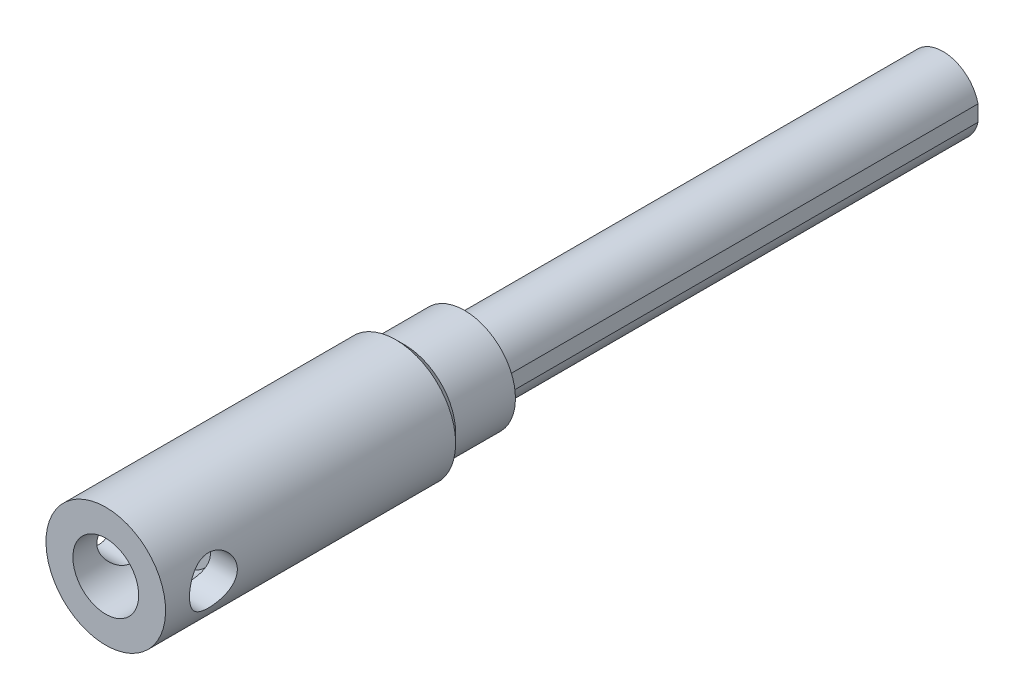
ISO-10303-21;
HEADER;
FILE_DESCRIPTION(('STEP AP214'),'2;1');
FILE_NAME('part.step','',(''),(''),'','','');
FILE_SCHEMA(('AUTOMOTIVE_DESIGN { 1 0 10303 214 1 1 1 1 }'));
ENDSEC;
DATA;
#1=APPLICATION_CONTEXT('core data for automotive mechanical design processes');
#2=APPLICATION_PROTOCOL_DEFINITION('international standard','automotive_design',2000,#1);
#3=PRODUCT_CONTEXT('',#1,'mechanical');
#4=PRODUCT('Part','Part','',(#3));
#5=PRODUCT_RELATED_PRODUCT_CATEGORY('part','',(#4));
#6=PRODUCT_DEFINITION_FORMATION('','',#4);
#7=PRODUCT_DEFINITION_CONTEXT('part definition',#1,'design');
#8=PRODUCT_DEFINITION('design','',#6,#7);
#9=PRODUCT_DEFINITION_SHAPE('','',#8);
#10=(LENGTH_UNIT() NAMED_UNIT(*) SI_UNIT(.MILLI.,.METRE.));
#11=(NAMED_UNIT(*) PLANE_ANGLE_UNIT() SI_UNIT($,.RADIAN.));
#12=(NAMED_UNIT(*) SI_UNIT($,.STERADIAN.) SOLID_ANGLE_UNIT());
#13=UNCERTAINTY_MEASURE_WITH_UNIT(LENGTH_MEASURE(1.E-05),#10,'distance_accuracy_value','');
#14=(GEOMETRIC_REPRESENTATION_CONTEXT(3) GLOBAL_UNCERTAINTY_ASSIGNED_CONTEXT((#13)) GLOBAL_UNIT_ASSIGNED_CONTEXT((#10,
#11,#12)) REPRESENTATION_CONTEXT('',''));
#15=CARTESIAN_POINT('',(0.,0.,0.));
#16=DIRECTION('',(0.,0.,1.));
#17=DIRECTION('',(1.,0.,0.));
#18=AXIS2_PLACEMENT_3D('',#15,#16,#17);
#19=CARTESIAN_POINT('',(-2.88675134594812,0.,124.));
#20=DIRECTION('',(0.866025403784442,-0.5,0.));
#21=DIRECTION('',(0.5,0.866025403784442,0.));
#22=AXIS2_PLACEMENT_3D('',#19,#20,#21);
#23=PLANE('',#22);
#24=DIRECTION('',(0.,0.,1.));
#25=VECTOR('',#24,1.);
#26=CARTESIAN_POINT('',(-1.44337567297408,2.5,124.));
#27=LINE('',#26,#25);
#28=CARTESIAN_POINT('',(-1.44337567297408,2.5,124.));
#29=VERTEX_POINT('',#28);
#30=CARTESIAN_POINT('',(-1.44337567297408,2.5,127.));
#31=VERTEX_POINT('',#30);
#32=EDGE_CURVE('E291',#29,#31,#27,.T.);
#33=ORIENTED_EDGE('',*,*,#32,.T.);
#34=DIRECTION('',(0.5,0.866025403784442,0.));
#35=VECTOR('',#34,1.);
#36=CARTESIAN_POINT('',(-2.88675134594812,0.,127.));
#37=LINE('',#36,#35);
#38=CARTESIAN_POINT('',(-2.88675134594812,0.,127.));
#39=VERTEX_POINT('',#38);
#40=EDGE_CURVE('E29',#39,#31,#37,.T.);
#41=ORIENTED_EDGE('',*,*,#40,.F.);
#42=DIRECTION('',(0.,0.,1.));
#43=VECTOR('',#42,1.);
#44=CARTESIAN_POINT('',(-2.88675134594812,0.,124.));
#45=LINE('',#44,#43);
#46=CARTESIAN_POINT('',(-2.88675134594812,0.,124.));
#47=VERTEX_POINT('',#46);
#48=EDGE_CURVE('E33',#47,#39,#45,.T.);
#49=ORIENTED_EDGE('',*,*,#48,.F.);
#50=DIRECTION('',(0.5,0.866025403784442,0.));
#51=VECTOR('',#50,1.);
#52=CARTESIAN_POINT('',(-2.88675134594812,0.,124.));
#53=LINE('',#52,#51);
#54=EDGE_CURVE('E252',#47,#29,#53,.T.);
#55=ORIENTED_EDGE('',*,*,#54,.T.);
#56=EDGE_LOOP('',(#33,#41,#49,#55));
#57=FACE_BOUND('',#56,.T.);
#58=ADVANCED_FACE('F14',(#57),#23,.T.);
#59=CARTESIAN_POINT('',(1.44337567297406,2.5,124.));
#60=DIRECTION('',(0.,1.,0.));
#61=DIRECTION('',(-1.,0.,0.));
#62=AXIS2_PLACEMENT_3D('',#59,#60,#61);
#63=PLANE('',#62);
#64=DIRECTION('',(0.,0.,1.));
#65=VECTOR('',#64,1.);
#66=CARTESIAN_POINT('',(1.44337567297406,2.5,124.));
#67=LINE('',#66,#65);
#68=CARTESIAN_POINT('',(1.44337567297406,2.5,124.));
#69=VERTEX_POINT('',#68);
#70=CARTESIAN_POINT('',(1.44337567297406,2.5,127.));
#71=VERTEX_POINT('',#70);
#72=EDGE_CURVE('E289',#69,#71,#67,.T.);
#73=ORIENTED_EDGE('',*,*,#72,.T.);
#74=DIRECTION('',(-1.,0.,0.));
#75=VECTOR('',#74,1.);
#76=CARTESIAN_POINT('',(1.44337567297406,2.5,127.));
#77=LINE('',#76,#75);
#78=EDGE_CURVE('E262',#71,#31,#77,.T.);
#79=ORIENTED_EDGE('',*,*,#78,.T.);
#80=ORIENTED_EDGE('',*,*,#32,.F.);
#81=DIRECTION('',(-1.,0.,0.));
#82=VECTOR('',#81,1.);
#83=CARTESIAN_POINT('',(1.44337567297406,2.5,124.));
#84=LINE('',#83,#82);
#85=EDGE_CURVE('E278',#69,#29,#84,.T.);
#86=ORIENTED_EDGE('',*,*,#85,.F.);
#87=EDGE_LOOP('',(#73,#79,#80,#86));
#88=FACE_BOUND('',#87,.T.);
#89=ADVANCED_FACE('F166',(#88),#63,.F.);
#90=CARTESIAN_POINT('',(2.88675134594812,0.,124.));
#91=DIRECTION('',(0.866025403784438,0.5,0.));
#92=DIRECTION('',(-0.5,0.866025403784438,0.));
#93=AXIS2_PLACEMENT_3D('',#90,#91,#92);
#94=PLANE('',#93);
#95=DIRECTION('',(0.,0.,1.));
#96=VECTOR('',#95,1.);
#97=CARTESIAN_POINT('',(2.88675134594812,0.,124.));
#98=LINE('',#97,#96);
#99=CARTESIAN_POINT('',(2.88675134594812,0.,124.));
#100=VERTEX_POINT('',#99);
#101=CARTESIAN_POINT('',(2.88675134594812,0.,127.));
#102=VERTEX_POINT('',#101);
#103=EDGE_CURVE('E287',#100,#102,#98,.T.);
#104=ORIENTED_EDGE('',*,*,#103,.T.);
#105=DIRECTION('',(-0.5,0.866025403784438,0.));
#106=VECTOR('',#105,1.);
#107=CARTESIAN_POINT('',(2.88675134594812,0.,127.));
#108=LINE('',#107,#106);
#109=EDGE_CURVE('E259',#102,#71,#108,.T.);
#110=ORIENTED_EDGE('',*,*,#109,.T.);
#111=ORIENTED_EDGE('',*,*,#72,.F.);
#112=DIRECTION('',(-0.5,0.866025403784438,0.));
#113=VECTOR('',#112,1.);
#114=CARTESIAN_POINT('',(2.88675134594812,0.,124.));
#115=LINE('',#114,#113);
#116=EDGE_CURVE('E275',#100,#69,#115,.T.);
#117=ORIENTED_EDGE('',*,*,#116,.F.);
#118=EDGE_LOOP('',(#104,#110,#111,#117));
#119=FACE_BOUND('',#118,.T.);
#120=ADVANCED_FACE('F171',(#119),#94,.F.);
#121=CARTESIAN_POINT('',(2.88675134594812,0.,124.));
#122=DIRECTION('',(-0.866025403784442,0.5,0.));
#123=DIRECTION('',(-0.5,-0.866025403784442,0.));
#124=AXIS2_PLACEMENT_3D('',#121,#122,#123);
#125=PLANE('',#124);
#126=DIRECTION('',(0.,0.,1.));
#127=VECTOR('',#126,1.);
#128=CARTESIAN_POINT('',(1.44337567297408,-2.5,124.));
#129=LINE('',#128,#127);
#130=CARTESIAN_POINT('',(1.44337567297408,-2.5,124.));
#131=VERTEX_POINT('',#130);
#132=CARTESIAN_POINT('',(1.44337567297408,-2.5,127.));
#133=VERTEX_POINT('',#132);
#134=EDGE_CURVE('E285',#131,#133,#129,.T.);
#135=ORIENTED_EDGE('',*,*,#134,.T.);
#136=DIRECTION('',(-0.5,-0.866025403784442,0.));
#137=VECTOR('',#136,1.);
#138=CARTESIAN_POINT('',(2.88675134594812,0.,127.));
#139=LINE('',#138,#137);
#140=EDGE_CURVE('E256',#102,#133,#139,.T.);
#141=ORIENTED_EDGE('',*,*,#140,.F.);
#142=ORIENTED_EDGE('',*,*,#103,.F.);
#143=DIRECTION('',(-0.5,-0.866025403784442,0.));
#144=VECTOR('',#143,1.);
#145=CARTESIAN_POINT('',(2.88675134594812,0.,124.));
#146=LINE('',#145,#144);
#147=EDGE_CURVE('E272',#100,#131,#146,.T.);
#148=ORIENTED_EDGE('',*,*,#147,.T.);
#149=EDGE_LOOP('',(#135,#141,#142,#148));
#150=FACE_BOUND('',#149,.T.);
#151=ADVANCED_FACE('F184',(#150),#125,.T.);
#152=CARTESIAN_POINT('',(-1.44337567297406,-2.5,124.));
#153=DIRECTION('',(0.,-1.,0.));
#154=DIRECTION('',(1.,0.,0.));
#155=AXIS2_PLACEMENT_3D('',#152,#153,#154);
#156=PLANE('',#155);
#157=DIRECTION('',(0.,0.,1.));
#158=VECTOR('',#157,1.);
#159=CARTESIAN_POINT('',(-1.44337567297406,-2.5,124.));
#160=LINE('',#159,#158);
#161=CARTESIAN_POINT('',(-1.44337567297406,-2.5,124.));
#162=VERTEX_POINT('',#161);
#163=CARTESIAN_POINT('',(-1.44337567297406,-2.5,127.));
#164=VERTEX_POINT('',#163);
#165=EDGE_CURVE('E283',#162,#164,#160,.T.);
#166=ORIENTED_EDGE('',*,*,#165,.T.);
#167=DIRECTION('',(1.,0.,0.));
#168=VECTOR('',#167,1.);
#169=CARTESIAN_POINT('',(-1.44337567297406,-2.5,127.));
#170=LINE('',#169,#168);
#171=EDGE_CURVE('E253',#164,#133,#170,.T.);
#172=ORIENTED_EDGE('',*,*,#171,.T.);
#173=ORIENTED_EDGE('',*,*,#134,.F.);
#174=DIRECTION('',(1.,0.,0.));
#175=VECTOR('',#174,1.);
#176=CARTESIAN_POINT('',(-1.44337567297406,-2.5,124.));
#177=LINE('',#176,#175);
#178=EDGE_CURVE('E269',#162,#131,#177,.T.);
#179=ORIENTED_EDGE('',*,*,#178,.F.);
#180=EDGE_LOOP('',(#166,#172,#173,#179));
#181=FACE_BOUND('',#180,.T.);
#182=ADVANCED_FACE('F180',(#181),#156,.F.);
#183=CARTESIAN_POINT('',(-2.88675134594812,0.,124.));
#184=DIRECTION('',(-0.866025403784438,-0.5,0.));
#185=DIRECTION('',(0.5,-0.866025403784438,0.));
#186=AXIS2_PLACEMENT_3D('',#183,#184,#185);
#187=PLANE('',#186);
#188=DIRECTION('',(0.5,-0.866025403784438,0.));
#189=VECTOR('',#188,1.);
#190=CARTESIAN_POINT('',(-2.88675134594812,0.,124.));
#191=LINE('',#190,#189);
#192=EDGE_CURVE('E266',#47,#162,#191,.T.);
#193=ORIENTED_EDGE('',*,*,#192,.F.);
#194=ORIENTED_EDGE('',*,*,#48,.T.);
#195=DIRECTION('',(0.5,-0.866025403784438,0.));
#196=VECTOR('',#195,1.);
#197=CARTESIAN_POINT('',(-2.88675134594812,0.,127.));
#198=LINE('',#197,#196);
#199=EDGE_CURVE('E249',#39,#164,#198,.T.);
#200=ORIENTED_EDGE('',*,*,#199,.T.);
#201=ORIENTED_EDGE('',*,*,#165,.F.);
#202=EDGE_LOOP('',(#193,#194,#200,#201));
#203=FACE_BOUND('',#202,.T.);
#204=ADVANCED_FACE('F177',(#203),#187,.F.);
#205=CARTESIAN_POINT('',(-1.44337567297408,2.5,124.));
#206=DIRECTION('',(0.,0.,1.));
#207=DIRECTION('',(0.,1.,0.));
#208=AXIS2_PLACEMENT_3D('',#205,#206,#207);
#209=PLANE('',#208);
#210=ORIENTED_EDGE('',*,*,#54,.F.);
#211=ORIENTED_EDGE('',*,*,#192,.T.);
#212=ORIENTED_EDGE('',*,*,#178,.T.);
#213=ORIENTED_EDGE('',*,*,#147,.F.);
#214=ORIENTED_EDGE('',*,*,#116,.T.);
#215=ORIENTED_EDGE('',*,*,#85,.T.);
#216=EDGE_LOOP('',(#210,#211,#212,#213,#214,#215));
#217=FACE_BOUND('',#216,.T.);
#218=ADVANCED_FACE('F176',(#217),#209,.T.);
#219=CARTESIAN_POINT('',(0.,0.,127.));
#220=DIRECTION('',(0.,0.,1.));
#221=DIRECTION('',(0.,1.,0.));
#222=AXIS2_PLACEMENT_3D('',#219,#220,#221);
#223=PLANE('',#222);
#224=CARTESIAN_POINT('',(0.,0.,127.));
#225=DIRECTION('',(0.,0.,1.));
#226=DIRECTION('',(0.,1.,0.));
#227=AXIS2_PLACEMENT_3D('',#224,#225,#226);
#228=CIRCLE('',#227,5.);
#229=CARTESIAN_POINT('',(0.,5.,127.));
#230=VERTEX_POINT('',#229);
#231=EDGE_CURVE('E9',#230,#230,#228,.T.);
#232=ORIENTED_EDGE('',*,*,#231,.T.);
#233=EDGE_LOOP('',(#232));
#234=FACE_BOUND('',#233,.T.);
#235=ORIENTED_EDGE('',*,*,#199,.F.);
#236=ORIENTED_EDGE('',*,*,#40,.T.);
#237=ORIENTED_EDGE('',*,*,#78,.F.);
#238=ORIENTED_EDGE('',*,*,#109,.F.);
#239=ORIENTED_EDGE('',*,*,#140,.T.);
#240=ORIENTED_EDGE('',*,*,#171,.F.);
#241=EDGE_LOOP('',(#235,#236,#237,#238,#239,#240));
#242=FACE_BOUND('',#241,.T.);
#243=ADVANCED_FACE('F16',(#234,#242),#223,.T.);
#244=CARTESIAN_POINT('',(0.,0.,111.));
#245=DIRECTION('',(0.,0.,1.));
#246=DIRECTION('',(0.,1.,0.));
#247=AXIS2_PLACEMENT_3D('',#244,#245,#246);
#248=CYLINDRICAL_SURFACE('',#247,5.);
#249=CARTESIAN_POINT('',(0.,0.,121.));
#250=DIRECTION('',(0.,0.,1.));
#251=DIRECTION('',(0.,1.,0.));
#252=AXIS2_PLACEMENT_3D('',#249,#250,#251);
#253=CIRCLE('',#252,5.);
#254=CARTESIAN_POINT('',(0.,5.,121.));
#255=VERTEX_POINT('',#254);
#256=EDGE_CURVE('E22',#255,#255,#253,.T.);
#257=ORIENTED_EDGE('',*,*,#256,.T.);
#258=EDGE_LOOP('',(#257));
#259=FACE_BOUND('',#258,.T.);
#260=ORIENTED_EDGE('',*,*,#231,.F.);
#261=EDGE_LOOP('',(#260));
#262=FACE_BOUND('',#261,.T.);
#263=ADVANCED_FACE('F191',(#259,#262),#248,.T.);
#264=CARTESIAN_POINT('',(0.,0.,0.));
#265=DIRECTION('',(0.,0.,1.));
#266=DIRECTION('',(-1.,0.,0.));
#267=AXIS2_PLACEMENT_3D('',#264,#265,#266);
#268=PLANE('',#267);
#269=DIRECTION('',(0.,-1.,0.));
#270=VECTOR('',#269,1.);
#271=CARTESIAN_POINT('',(5.85,-1.33322916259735,0.));
#272=LINE('',#271,#270);
#273=CARTESIAN_POINT('',(5.85,1.33322916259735,0.));
#274=VERTEX_POINT('',#273);
#275=CARTESIAN_POINT('',(5.85,-1.33322916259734,0.));
#276=VERTEX_POINT('',#275);
#277=EDGE_CURVE('E91',#274,#276,#272,.T.);
#278=ORIENTED_EDGE('',*,*,#277,.T.);
#279=CARTESIAN_POINT('',(0.,0.,0.));
#280=DIRECTION('',(0.,0.,1.));
#281=DIRECTION('',(-1.,0.,0.));
#282=AXIS2_PLACEMENT_3D('',#279,#280,#281);
#283=CIRCLE('',#282,6.);
#284=EDGE_CURVE('E83',#274,#276,#283,.T.);
#285=ORIENTED_EDGE('',*,*,#284,.F.);
#286=EDGE_LOOP('',(#278,#285));
#287=FACE_BOUND('',#286,.T.);
#288=ADVANCED_FACE('F95',(#287),#268,.F.);
#289=CARTESIAN_POINT('',(5.85,-1.33322916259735,100.));
#290=DIRECTION('',(1.,0.,0.));
#291=DIRECTION('',(0.,0.,1.));
#292=AXIS2_PLACEMENT_3D('',#289,#290,#291);
#293=PLANE('',#292);
#294=DIRECTION('',(0.,1.,0.));
#295=VECTOR('',#294,1.);
#296=CARTESIAN_POINT('',(5.85,8.5,80.));
#297=LINE('',#296,#295);
#298=CARTESIAN_POINT('',(5.85,-1.33322916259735,80.));
#299=VERTEX_POINT('',#298);
#300=CARTESIAN_POINT('',(5.85,1.33322916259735,80.));
#301=VERTEX_POINT('',#300);
#302=EDGE_CURVE('E246',#299,#301,#297,.T.);
#303=ORIENTED_EDGE('',*,*,#302,.F.);
#304=DIRECTION('',(0.,0.,-1.));
#305=VECTOR('',#304,1.);
#306=CARTESIAN_POINT('',(5.85,-1.33322916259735,100.));
#307=LINE('',#306,#305);
#308=EDGE_CURVE('E88',#299,#276,#307,.T.);
#309=ORIENTED_EDGE('',*,*,#308,.T.);
#310=ORIENTED_EDGE('',*,*,#277,.F.);
#311=DIRECTION('',(0.,0.,-1.));
#312=VECTOR('',#311,1.);
#313=CARTESIAN_POINT('',(5.85,1.33322916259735,100.));
#314=LINE('',#313,#312);
#315=EDGE_CURVE('E78',#301,#274,#314,.T.);
#316=ORIENTED_EDGE('',*,*,#315,.F.);
#317=EDGE_LOOP('',(#303,#309,#310,#316));
#318=FACE_BOUND('',#317,.T.);
#319=ADVANCED_FACE('F92',(#318),#293,.T.);
#320=CARTESIAN_POINT('',(0.,0.,100.));
#321=DIRECTION('',(0.,0.,-1.));
#322=DIRECTION('',(1.,0.,0.));
#323=AXIS2_PLACEMENT_3D('',#320,#321,#322);
#324=CYLINDRICAL_SURFACE('',#323,6.);
#325=ORIENTED_EDGE('',*,*,#308,.F.);
#326=CARTESIAN_POINT('',(0.,0.,80.));
#327=DIRECTION('',(0.,0.,1.));
#328=DIRECTION('',(2.05103273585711E-10,-1.,0.));
#329=AXIS2_PLACEMENT_3D('',#326,#327,#328);
#330=CIRCLE('',#329,6.);
#331=EDGE_CURVE('E84',#299,#301,#330,.F.);
#332=ORIENTED_EDGE('',*,*,#331,.T.);
#333=ORIENTED_EDGE('',*,*,#315,.T.);
#334=ORIENTED_EDGE('',*,*,#284,.T.);
#335=EDGE_LOOP('',(#325,#332,#333,#334));
#336=FACE_BOUND('',#335,.T.);
#337=ADVANCED_FACE('F81',(#336),#324,.T.);
#338=CARTESIAN_POINT('',(0.,8.5,80.));
#339=DIRECTION('',(0.,0.,1.));
#340=DIRECTION('',(0.,-1.,0.));
#341=AXIS2_PLACEMENT_3D('',#338,#339,#340);
#342=PLANE('',#341);
#343=CARTESIAN_POINT('',(0.,0.,80.));
#344=DIRECTION('',(0.,0.,-1.));
#345=DIRECTION('',(0.,1.,0.));
#346=AXIS2_PLACEMENT_3D('',#343,#344,#345);
#347=CIRCLE('',#346,8.5);
#348=CARTESIAN_POINT('',(0.,8.5,80.));
#349=VERTEX_POINT('',#348);
#350=EDGE_CURVE('E222',#349,#349,#347,.T.);
#351=ORIENTED_EDGE('',*,*,#350,.T.);
#352=EDGE_LOOP('',(#351));
#353=FACE_BOUND('',#352,.T.);
#354=ORIENTED_EDGE('',*,*,#331,.F.);
#355=ORIENTED_EDGE('',*,*,#302,.T.);
#356=EDGE_LOOP('',(#354,#355));
#357=FACE_BOUND('',#356,.T.);
#358=ADVANCED_FACE('F126',(#353,#357),#342,.F.);
#359=CARTESIAN_POINT('',(0.,0.,80.));
#360=DIRECTION('',(0.,0.,-1.));
#361=DIRECTION('',(0.,1.,0.));
#362=AXIS2_PLACEMENT_3D('',#359,#360,#361);
#363=CYLINDRICAL_SURFACE('',#362,8.5);
#364=ORIENTED_EDGE('',*,*,#350,.F.);
#365=EDGE_LOOP('',(#364));
#366=FACE_BOUND('',#365,.T.);
#367=CARTESIAN_POINT('',(0.,0.,90.));
#368=DIRECTION('',(0.,0.,-1.));
#369=DIRECTION('',(0.,1.,0.));
#370=AXIS2_PLACEMENT_3D('',#367,#368,#369);
#371=CIRCLE('',#370,8.5);
#372=CARTESIAN_POINT('',(0.,8.5,90.));
#373=VERTEX_POINT('',#372);
#374=EDGE_CURVE('E220',#373,#373,#371,.T.);
#375=ORIENTED_EDGE('',*,*,#374,.T.);
#376=EDGE_LOOP('',(#375));
#377=FACE_BOUND('',#376,.T.);
#378=ADVANCED_FACE('F151',(#366,#377),#363,.T.);
#379=CARTESIAN_POINT('',(0.,0.,90.));
#380=DIRECTION('',(0.,0.,1.));
#381=DIRECTION('',(0.,-1.,0.));
#382=AXIS2_PLACEMENT_3D('',#379,#380,#381);
#383=CONICAL_SURFACE('',#382,8.5,0.785398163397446);
#384=CARTESIAN_POINT('',(0.,0.,91.5));
#385=DIRECTION('',(0.,0.,1.));
#386=DIRECTION('',(0.,-1.,0.));
#387=AXIS2_PLACEMENT_3D('',#384,#385,#386);
#388=CIRCLE('',#387,10.);
#389=CARTESIAN_POINT('',(0.,-10.,91.5));
#390=VERTEX_POINT('',#389);
#391=EDGE_CURVE('E145',#390,#390,#388,.T.);
#392=ORIENTED_EDGE('',*,*,#391,.F.);
#393=EDGE_LOOP('',(#392));
#394=FACE_BOUND('',#393,.T.);
#395=ORIENTED_EDGE('',*,*,#374,.F.);
#396=EDGE_LOOP('',(#395));
#397=FACE_BOUND('',#396,.T.);
#398=ADVANCED_FACE('F124',(#394,#397),#383,.T.);
#399=CARTESIAN_POINT('',(0.,0.,80.));
#400=DIRECTION('',(0.,0.,-1.));
#401=DIRECTION('',(0.,1.,0.));
#402=AXIS2_PLACEMENT_3D('',#399,#400,#401);
#403=CYLINDRICAL_SURFACE('',#402,10.);
#404=ORIENTED_EDGE('',*,*,#391,.T.);
#405=EDGE_LOOP('',(#404));
#406=FACE_BOUND('',#405,.T.);
#407=CARTESIAN_POINT('',(-10.,0.,136.));
#408=CARTESIAN_POINT('',(-9.99999886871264,-0.107549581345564,135.999998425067));
#409=CARTESIAN_POINT('',(-9.99825999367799,-0.215132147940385,135.99565632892));
#410=CARTESIAN_POINT('',(-9.99134740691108,-0.429535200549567,135.978326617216));
#411=CARTESIAN_POINT('',(-9.98617152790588,-0.536355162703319,135.965333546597));
#412=CARTESIAN_POINT('',(-9.97250573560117,-0.748635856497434,135.930791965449));
#413=CARTESIAN_POINT('',(-9.96400865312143,-0.854093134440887,135.90922494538));
#414=CARTESIAN_POINT('',(-9.94393017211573,-1.06266761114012,135.857758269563));
#415=CARTESIAN_POINT('',(-9.93234752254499,-1.16578384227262,135.827855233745));
#416=CARTESIAN_POINT('',(-9.89349112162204,-1.46979509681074,135.726277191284));
#417=CARTESIAN_POINT('',(-9.86204458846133,-1.66629107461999,135.642578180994));
#418=CARTESIAN_POINT('',(-9.79113035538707,-2.04217417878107,135.44595378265));
#419=CARTESIAN_POINT('',(-9.75166544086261,-2.22156721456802,135.333038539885));
#420=CARTESIAN_POINT('',(-9.66661825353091,-2.56699339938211,135.075531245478));
#421=CARTESIAN_POINT('',(-9.62084608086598,-2.73212223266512,134.929787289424));
#422=CARTESIAN_POINT('',(-9.5292113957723,-3.03635232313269,134.613199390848));
#423=CARTESIAN_POINT('',(-9.48334885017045,-3.17544084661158,134.442343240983));
#424=CARTESIAN_POINT('',(-9.39445587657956,-3.42974847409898,134.071144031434));
#425=CARTESIAN_POINT('',(-9.35164233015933,-3.5436297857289,133.869827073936));
#426=CARTESIAN_POINT('',(-9.27667293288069,-3.73550961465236,133.448927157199));
#427=CARTESIAN_POINT('',(-9.24451202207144,-3.81352517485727,133.229352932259));
#428=CARTESIAN_POINT('',(-9.19652715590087,-3.92779760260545,132.788575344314));
#429=CARTESIAN_POINT('',(-9.18002840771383,-3.96578791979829,132.567897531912));
#430=CARTESIAN_POINT('',(-9.16328008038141,-4.00434593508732,132.122730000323));
#431=CARTESIAN_POINT('',(-9.163022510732,-4.00493203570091,131.898242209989));
#432=CARTESIAN_POINT('',(-9.178210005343,-3.96997873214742,131.468486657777));
#433=CARTESIAN_POINT('',(-9.19256349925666,-3.93695062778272,131.262968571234));
#434=CARTESIAN_POINT('',(-9.23352375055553,-3.83989376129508,130.86068088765));
#435=CARTESIAN_POINT('',(-9.2601326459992,-3.77585958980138,130.663912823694));
#436=CARTESIAN_POINT('',(-9.32318970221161,-3.61738946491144,130.279964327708));
#437=CARTESIAN_POINT('',(-9.35982758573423,-3.5223597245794,130.093061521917));
#438=CARTESIAN_POINT('',(-9.43876232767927,-3.30501292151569,129.73716836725));
#439=CARTESIAN_POINT('',(-9.48106130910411,-3.18268561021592,129.568184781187));
#440=CARTESIAN_POINT('',(-9.5705347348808,-2.90310119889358,129.239180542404));
#441=CARTESIAN_POINT('',(-9.61783329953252,-2.74387492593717,129.08086254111));
#442=CARTESIAN_POINT('',(-9.70919649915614,-2.4006288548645,128.792631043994));
#443=CARTESIAN_POINT('',(-9.75326048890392,-2.21660413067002,128.662723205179));
#444=CARTESIAN_POINT('',(-9.83429362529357,-1.82415530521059,128.432765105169));
#445=CARTESIAN_POINT('',(-9.87110540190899,-1.61532098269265,128.333355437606));
#446=CARTESIAN_POINT('',(-9.93229656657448,-1.18204753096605,128.171664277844));
#447=CARTESIAN_POINT('',(-9.95668226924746,-0.957616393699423,128.109363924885));
#448=CARTESIAN_POINT('',(-9.98912279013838,-0.513791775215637,128.027103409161));
#449=CARTESIAN_POINT('',(-9.99805891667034,-0.294886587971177,128.004855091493));
#450=CARTESIAN_POINT('',(-10.0013695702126,0.143690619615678,127.996573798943));
#451=CARTESIAN_POINT('',(-9.99574787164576,0.363362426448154,128.010531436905));
#452=CARTESIAN_POINT('',(-9.97115134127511,0.786865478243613,128.072583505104));
#453=CARTESIAN_POINT('',(-9.95278782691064,0.990964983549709,128.119115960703));
#454=CARTESIAN_POINT('',(-9.90518882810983,1.38827085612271,128.242871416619));
#455=CARTESIAN_POINT('',(-9.87595194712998,1.5814758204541,128.320098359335));
#456=CARTESIAN_POINT('',(-9.80833189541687,1.95815757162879,128.505569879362));
#457=CARTESIAN_POINT('',(-9.76969631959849,2.14115604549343,128.614690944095));
#458=CARTESIAN_POINT('',(-9.68746729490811,2.4868871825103,128.859880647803));
#459=CARTESIAN_POINT('',(-9.64387186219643,2.64961168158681,128.995960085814));
#460=CARTESIAN_POINT('',(-9.55290235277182,2.96144608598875,129.301740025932));
#461=CARTESIAN_POINT('',(-9.5054688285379,3.10894786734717,129.473067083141));
#462=CARTESIAN_POINT('',(-9.41483345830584,3.37350239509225,129.83888016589));
#463=CARTESIAN_POINT('',(-9.37163231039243,3.49055012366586,130.033370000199));
#464=CARTESIAN_POINT('',(-9.2942859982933,3.69161500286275,130.442923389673));
#465=CARTESIAN_POINT('',(-9.26023261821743,3.77530118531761,130.658168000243));
#466=CARTESIAN_POINT('',(-9.20647346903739,3.90459244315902,131.101467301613));
#467=CARTESIAN_POINT('',(-9.18675711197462,3.95022562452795,131.329512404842));
#468=CARTESIAN_POINT('',(-9.1654351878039,3.99943122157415,131.774255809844));
#469=CARTESIAN_POINT('',(-9.16262842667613,4.00579411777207,131.990589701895));
#470=CARTESIAN_POINT('',(-9.1722967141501,3.98360636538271,132.421089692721));
#471=CARTESIAN_POINT('',(-9.18476982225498,3.95506015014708,132.635256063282));
#472=CARTESIAN_POINT('',(-9.22253300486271,3.86614256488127,133.04666446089));
#473=CARTESIAN_POINT('',(-9.24729672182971,3.80707437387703,133.244240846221));
#474=CARTESIAN_POINT('',(-9.30647993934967,3.66001151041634,133.62675696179));
#475=CARTESIAN_POINT('',(-9.34090210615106,3.57200884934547,133.811693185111));
#476=CARTESIAN_POINT('',(-9.41797252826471,3.36374310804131,134.175220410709));
#477=CARTESIAN_POINT('',(-9.46097893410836,3.24192140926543,134.352841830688));
#478=CARTESIAN_POINT('',(-9.54927479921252,2.97179350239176,134.685982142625));
#479=CARTESIAN_POINT('',(-9.59456494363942,2.82347931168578,134.84149434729));
#480=CARTESIAN_POINT('',(-9.68587647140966,2.49297412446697,135.136423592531));
#481=CARTESIAN_POINT('',(-9.73175488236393,2.30921017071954,135.274143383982));
#482=CARTESIAN_POINT('',(-9.7949502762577,2.01716584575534,135.456048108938));
#483=CARTESIAN_POINT('',(-9.81509269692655,1.91699501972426,135.512607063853));
#484=CARTESIAN_POINT('',(-9.85294835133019,1.71180110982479,135.617037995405));
#485=CARTESIAN_POINT('',(-9.87066269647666,1.60678027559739,135.664913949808));
#486=CARTESIAN_POINT('',(-9.9028559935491,1.39454646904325,135.750747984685));
#487=CARTESIAN_POINT('',(-9.91738778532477,1.28740777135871,135.788870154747));
#488=CARTESIAN_POINT('',(-9.94319722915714,1.06995577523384,135.855921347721));
#489=CARTESIAN_POINT('',(-9.95447639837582,0.959643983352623,135.88485465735));
#490=CARTESIAN_POINT('',(-9.97343330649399,0.736945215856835,135.933174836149));
#491=CARTESIAN_POINT('',(-9.98112017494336,0.62456426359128,135.952585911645));
#492=CARTESIAN_POINT('',(-9.99270031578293,0.39841913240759,135.981738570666));
#493=CARTESIAN_POINT('',(-9.99659628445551,0.284655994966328,135.991487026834));
#494=CARTESIAN_POINT('',(-9.99951445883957,0.113830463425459,135.998785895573));
#495=CARTESIAN_POINT('',(-10.0000005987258,0.0569198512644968,136.000000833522));
#496=CARTESIAN_POINT('',(-10.,0.,136.));
#497=B_SPLINE_CURVE_WITH_KNOTS('',3,(#407,#408,#409,#410,#411,#412,#413,#414,#415,#416,#417,
#418,#419,#420,#421,#422,#423,#424,#425,#426,#427,#428,#429,#430,#431,#432,#433,#434,#435,#436,
#437,#438,#439,#440,#441,#442,#443,#444,#445,#446,#447,#448,#449,#450,#451,#452,#453,#454,#455,
#456,#457,#458,#459,#460,#461,#462,#463,#464,#465,#466,#467,#468,#469,#470,#471,#472,#473,#474,
#475,#476,#477,#478,#479,#480,#481,#482,#483,#484,#485,#486,#487,#488,#489,#490,#491,#492,#493,
#494,#495,#496),.UNSPECIFIED.,.T.,.F.,(4,2,2,2,2,2,2,2,2,2,2,2,2,2,2,2,2,2,2,2,2,2,2,2,2,2,2,2,
2,2,2,2,2,2,2,2,2,2,2,2,2,2,2,2,4),(0.,0.322603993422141,0.645411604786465,0.968919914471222,
1.29255959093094,1.93701523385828,2.58124739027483,3.25313995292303,3.92536021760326,
4.62749749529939,5.32930078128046,5.99927442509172,6.66891844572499,7.29195888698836,
7.91510806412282,8.55097484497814,9.18708075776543,9.87235930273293,10.5577741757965,
11.256730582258,11.9553314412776,12.6125760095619,13.2696501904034,13.8972014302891,
14.5248332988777,15.171662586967,15.8187515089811,16.50856181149,17.1984856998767,
17.8950932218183,18.5911857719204,19.2371857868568,19.8831037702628,20.5034786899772,
21.1240250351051,21.7801016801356,22.4363763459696,23.1352007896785,23.4851924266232,
23.8350233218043,24.1785111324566,24.52183846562,24.8642884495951,25.2064946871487,
25.3772305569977),.UNSPECIFIED.);
#498=CARTESIAN_POINT('',(-10.,0.,136.));
#499=VERTEX_POINT('',#498);
#500=EDGE_CURVE('E139',#499,#499,#497,.T.);
#501=ORIENTED_EDGE('',*,*,#500,.T.);
#502=EDGE_LOOP('',(#501));
#503=FACE_BOUND('',#502,.T.);
#504=CARTESIAN_POINT('',(10.,0.,136.));
#505=CARTESIAN_POINT('',(9.99999886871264,0.107549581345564,135.999998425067));
#506=CARTESIAN_POINT('',(9.99825999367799,0.215132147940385,135.99565632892));
#507=CARTESIAN_POINT('',(9.99134740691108,0.429535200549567,135.978326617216));
#508=CARTESIAN_POINT('',(9.98617152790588,0.53635516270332,135.965333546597));
#509=CARTESIAN_POINT('',(9.97250573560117,0.748635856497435,135.930791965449));
#510=CARTESIAN_POINT('',(9.96400865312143,0.854093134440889,135.90922494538));
#511=CARTESIAN_POINT('',(9.94393017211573,1.06266761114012,135.857758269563));
#512=CARTESIAN_POINT('',(9.93234752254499,1.16578384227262,135.827855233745));
#513=CARTESIAN_POINT('',(9.89349112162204,1.46979509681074,135.726277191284));
#514=CARTESIAN_POINT('',(9.86204458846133,1.66629107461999,135.642578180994));
#515=CARTESIAN_POINT('',(9.79113035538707,2.04217417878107,135.44595378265));
#516=CARTESIAN_POINT('',(9.75166544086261,2.22156721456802,135.333038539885));
#517=CARTESIAN_POINT('',(9.66661825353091,2.56699339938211,135.075531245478));
#518=CARTESIAN_POINT('',(9.62084608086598,2.73212223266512,134.929787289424));
#519=CARTESIAN_POINT('',(9.5292113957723,3.03635232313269,134.613199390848));
#520=CARTESIAN_POINT('',(9.48334885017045,3.17544084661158,134.442343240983));
#521=CARTESIAN_POINT('',(9.39445587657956,3.42974847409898,134.071144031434));
#522=CARTESIAN_POINT('',(9.35164233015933,3.5436297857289,133.869827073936));
#523=CARTESIAN_POINT('',(9.27667293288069,3.73550961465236,133.448927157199));
#524=CARTESIAN_POINT('',(9.24451202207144,3.81352517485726,133.229352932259));
#525=CARTESIAN_POINT('',(9.19652715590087,3.92779760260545,132.788575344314));
#526=CARTESIAN_POINT('',(9.18002840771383,3.9657879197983,132.567897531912));
#527=CARTESIAN_POINT('',(9.16328008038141,4.00434593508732,132.122730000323));
#528=CARTESIAN_POINT('',(9.163022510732,4.00493203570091,131.898242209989));
#529=CARTESIAN_POINT('',(9.178210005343,3.96997873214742,131.468486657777));
#530=CARTESIAN_POINT('',(9.19256349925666,3.93695062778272,131.262968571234));
#531=CARTESIAN_POINT('',(9.23352375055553,3.83989376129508,130.86068088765));
#532=CARTESIAN_POINT('',(9.2601326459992,3.77585958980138,130.663912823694));
#533=CARTESIAN_POINT('',(9.32318970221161,3.61738946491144,130.279964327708));
#534=CARTESIAN_POINT('',(9.35982758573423,3.5223597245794,130.093061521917));
#535=CARTESIAN_POINT('',(9.43876232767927,3.30501292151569,129.73716836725));
#536=CARTESIAN_POINT('',(9.48106130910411,3.18268561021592,129.568184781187));
#537=CARTESIAN_POINT('',(9.5705347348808,2.90310119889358,129.239180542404));
#538=CARTESIAN_POINT('',(9.61783329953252,2.74387492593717,129.08086254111));
#539=CARTESIAN_POINT('',(9.70919649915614,2.4006288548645,128.792631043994));
#540=CARTESIAN_POINT('',(9.75326048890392,2.21660413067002,128.662723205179));
#541=CARTESIAN_POINT('',(9.83429362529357,1.82415530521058,128.432765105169));
#542=CARTESIAN_POINT('',(9.87110540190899,1.61532098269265,128.333355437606));
#543=CARTESIAN_POINT('',(9.93229656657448,1.18204753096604,128.171664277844));
#544=CARTESIAN_POINT('',(9.95668226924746,0.957616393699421,128.109363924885));
#545=CARTESIAN_POINT('',(9.98912279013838,0.513791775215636,128.027103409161));
#546=CARTESIAN_POINT('',(9.99805891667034,0.294886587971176,128.004855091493));
#547=CARTESIAN_POINT('',(10.0013695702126,-0.14369061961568,127.996573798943));
#548=CARTESIAN_POINT('',(9.99574787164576,-0.363362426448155,128.010531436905));
#549=CARTESIAN_POINT('',(9.97115134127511,-0.786865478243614,128.072583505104));
#550=CARTESIAN_POINT('',(9.95278782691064,-0.99096498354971,128.119115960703));
#551=CARTESIAN_POINT('',(9.90518882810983,-1.38827085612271,128.242871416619));
#552=CARTESIAN_POINT('',(9.87595194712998,-1.5814758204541,128.320098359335));
#553=CARTESIAN_POINT('',(9.80833189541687,-1.95815757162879,128.505569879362));
#554=CARTESIAN_POINT('',(9.76969631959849,-2.14115604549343,128.614690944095));
#555=CARTESIAN_POINT('',(9.68746729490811,-2.48688718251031,128.859880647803));
#556=CARTESIAN_POINT('',(9.64387186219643,-2.64961168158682,128.995960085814));
#557=CARTESIAN_POINT('',(9.55290235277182,-2.96144608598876,129.301740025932));
#558=CARTESIAN_POINT('',(9.5054688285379,-3.10894786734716,129.473067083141));
#559=CARTESIAN_POINT('',(9.41483345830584,-3.37350239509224,129.83888016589));
#560=CARTESIAN_POINT('',(9.37163231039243,-3.49055012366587,130.033370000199));
#561=CARTESIAN_POINT('',(9.2942859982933,-3.69161500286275,130.442923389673));
#562=CARTESIAN_POINT('',(9.26023261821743,-3.7753011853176,130.658168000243));
#563=CARTESIAN_POINT('',(9.20647346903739,-3.90459244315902,131.101467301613));
#564=CARTESIAN_POINT('',(9.18675711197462,-3.95022562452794,131.329512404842));
#565=CARTESIAN_POINT('',(9.1654351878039,-3.99943122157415,131.774255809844));
#566=CARTESIAN_POINT('',(9.16262842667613,-4.00579411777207,131.990589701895));
#567=CARTESIAN_POINT('',(9.1722967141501,-3.98360636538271,132.421089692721));
#568=CARTESIAN_POINT('',(9.18476982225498,-3.95506015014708,132.635256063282));
#569=CARTESIAN_POINT('',(9.22253300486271,-3.86614256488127,133.04666446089));
#570=CARTESIAN_POINT('',(9.24729672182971,-3.80707437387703,133.244240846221));
#571=CARTESIAN_POINT('',(9.30647993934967,-3.66001151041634,133.62675696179));
#572=CARTESIAN_POINT('',(9.34090210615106,-3.57200884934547,133.811693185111));
#573=CARTESIAN_POINT('',(9.41797252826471,-3.36374310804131,134.175220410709));
#574=CARTESIAN_POINT('',(9.46097893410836,-3.24192140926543,134.352841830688));
#575=CARTESIAN_POINT('',(9.54927479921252,-2.97179350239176,134.685982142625));
#576=CARTESIAN_POINT('',(9.59456494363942,-2.82347931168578,134.84149434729));
#577=CARTESIAN_POINT('',(9.68587647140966,-2.49297412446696,135.136423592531));
#578=CARTESIAN_POINT('',(9.73175488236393,-2.30921017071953,135.274143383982));
#579=CARTESIAN_POINT('',(9.7949502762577,-2.01716584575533,135.456048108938));
#580=CARTESIAN_POINT('',(9.81509269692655,-1.91699501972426,135.512607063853));
#581=CARTESIAN_POINT('',(9.85294835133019,-1.71180110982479,135.617037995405));
#582=CARTESIAN_POINT('',(9.87066269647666,-1.60678027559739,135.664913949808));
#583=CARTESIAN_POINT('',(9.9028559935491,-1.39454646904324,135.750747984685));
#584=CARTESIAN_POINT('',(9.91738778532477,-1.2874077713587,135.788870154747));
#585=CARTESIAN_POINT('',(9.94319722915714,-1.06995577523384,135.855921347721));
#586=CARTESIAN_POINT('',(9.95447639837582,-0.959643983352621,135.88485465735));
#587=CARTESIAN_POINT('',(9.97343330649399,-0.736945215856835,135.933174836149));
#588=CARTESIAN_POINT('',(9.98112017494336,-0.624564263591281,135.952585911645));
#589=CARTESIAN_POINT('',(9.99270031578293,-0.398419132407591,135.981738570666));
#590=CARTESIAN_POINT('',(9.99659628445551,-0.284655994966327,135.991487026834));
#591=CARTESIAN_POINT('',(9.99951445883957,-0.113830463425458,135.998785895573));
#592=CARTESIAN_POINT('',(10.0000005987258,-0.0569198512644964,136.000000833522));
#593=CARTESIAN_POINT('',(10.,0.,136.));
#594=B_SPLINE_CURVE_WITH_KNOTS('',3,(#504,#505,#506,#507,#508,#509,#510,#511,#512,#513,#514,
#515,#516,#517,#518,#519,#520,#521,#522,#523,#524,#525,#526,#527,#528,#529,#530,#531,#532,#533,
#534,#535,#536,#537,#538,#539,#540,#541,#542,#543,#544,#545,#546,#547,#548,#549,#550,#551,#552,
#553,#554,#555,#556,#557,#558,#559,#560,#561,#562,#563,#564,#565,#566,#567,#568,#569,#570,#571,
#572,#573,#574,#575,#576,#577,#578,#579,#580,#581,#582,#583,#584,#585,#586,#587,#588,#589,#590,
#591,#592,#593),.UNSPECIFIED.,.T.,.F.,(4,2,2,2,2,2,2,2,2,2,2,2,2,2,2,2,2,2,2,2,2,2,2,2,2,2,2,2,
2,2,2,2,2,2,2,2,2,2,2,2,2,2,2,2,4),(0.,0.322603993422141,0.645411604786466,0.968919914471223,
1.29255959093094,1.93701523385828,2.58124739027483,3.25313995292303,3.92536021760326,
4.62749749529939,5.32930078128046,5.99927442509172,6.668918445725,7.29195888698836,
7.91510806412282,8.55097484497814,9.18708075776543,9.87235930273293,10.5577741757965,
11.256730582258,11.9553314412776,12.612576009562,13.2696501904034,13.8972014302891,
14.5248332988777,15.171662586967,15.8187515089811,16.50856181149,17.1984856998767,
17.8950932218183,18.5911857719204,19.2371857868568,19.8831037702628,20.5034786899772,
21.1240250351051,21.7801016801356,22.4363763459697,23.1352007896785,23.4851924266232,
23.8350233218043,24.1785111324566,24.5218384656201,24.8642884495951,25.2064946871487,
25.3772305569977),.UNSPECIFIED.);
#595=CARTESIAN_POINT('',(10.,0.,136.));
#596=VERTEX_POINT('',#595);
#597=EDGE_CURVE('E131',#596,#596,#594,.T.);
#598=ORIENTED_EDGE('',*,*,#597,.T.);
#599=EDGE_LOOP('',(#598));
#600=FACE_BOUND('',#599,.T.);
#601=CARTESIAN_POINT('',(0.,0.,140.));
#602=DIRECTION('',(0.,0.,-1.));
#603=DIRECTION('',(0.,1.,0.));
#604=AXIS2_PLACEMENT_3D('',#601,#602,#603);
#605=CIRCLE('',#604,10.);
#606=CARTESIAN_POINT('',(0.,10.,140.));
#607=VERTEX_POINT('',#606);
#608=EDGE_CURVE('E215',#607,#607,#605,.T.);
#609=ORIENTED_EDGE('',*,*,#608,.T.);
#610=EDGE_LOOP('',(#609));
#611=FACE_BOUND('',#610,.T.);
#612=ADVANCED_FACE('F123',(#406,#503,#600,#611),#403,.T.);
#613=CARTESIAN_POINT('',(0.,10.,140.));
#614=DIRECTION('',(0.,0.,-1.));
#615=DIRECTION('',(0.,1.,0.));
#616=AXIS2_PLACEMENT_3D('',#613,#614,#615);
#617=PLANE('',#616);
#618=ORIENTED_EDGE('',*,*,#608,.F.);
#619=EDGE_LOOP('',(#618));
#620=FACE_BOUND('',#619,.T.);
#621=CARTESIAN_POINT('',(0.,0.,140.));
#622=DIRECTION('',(0.,0.,-1.));
#623=DIRECTION('',(0.,1.,0.));
#624=AXIS2_PLACEMENT_3D('',#621,#622,#623);
#625=CIRCLE('',#624,5.5);
#626=CARTESIAN_POINT('',(0.,5.5,140.));
#627=VERTEX_POINT('',#626);
#628=EDGE_CURVE('E212',#627,#627,#625,.T.);
#629=ORIENTED_EDGE('',*,*,#628,.T.);
#630=EDGE_LOOP('',(#629));
#631=FACE_BOUND('',#630,.T.);
#632=ADVANCED_FACE('F149',(#620,#631),#617,.F.);
#633=CARTESIAN_POINT('',(-10.,0.,132.));
#634=DIRECTION('',(1.,0.,0.));
#635=DIRECTION('',(0.,0.,1.));
#636=AXIS2_PLACEMENT_3D('',#633,#634,#635);
#637=CYLINDRICAL_SURFACE('',#636,4.);
#638=ORIENTED_EDGE('',*,*,#597,.F.);
#639=EDGE_LOOP('',(#638));
#640=FACE_BOUND('',#639,.T.);
#641=CARTESIAN_POINT('',(5.5,0.,136.));
#642=CARTESIAN_POINT('',(5.49999903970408,-0.0984084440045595,135.999998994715));
#643=CARTESIAN_POINT('',(5.49735205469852,-0.196846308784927,135.996361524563));
#644=CARTESIAN_POINT('',(5.48682476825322,-0.39294987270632,135.981867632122));
#645=CARTESIAN_POINT('',(5.47894116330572,-0.490615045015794,135.971006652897));
#646=CARTESIAN_POINT('',(5.45810479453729,-0.68455547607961,135.942208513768));
#647=CARTESIAN_POINT('',(5.44514186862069,-0.780827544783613,135.92425716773));
#648=CARTESIAN_POINT('',(5.414451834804,-0.971092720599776,135.881559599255));
#649=CARTESIAN_POINT('',(5.39672260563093,-1.06508479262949,135.856810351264));
#650=CARTESIAN_POINT('',(5.33719436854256,-1.34149727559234,135.773221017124));
#651=CARTESIAN_POINT('',(5.28889729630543,-1.51974308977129,135.704826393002));
#652=CARTESIAN_POINT('',(5.17868357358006,-1.86104833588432,135.54570801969));
#653=CARTESIAN_POINT('',(5.11677145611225,-2.02411279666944,135.454991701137));
#654=CARTESIAN_POINT('',(4.97726899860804,-2.3474519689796,135.244986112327));
#655=CARTESIAN_POINT('',(4.89876490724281,-2.50612448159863,135.123848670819));
#656=CARTESIAN_POINT('',(4.73555684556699,-2.8023446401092,134.861145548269));
#657=CARTESIAN_POINT('',(4.65084317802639,-2.93985815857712,134.719547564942));
#658=CARTESIAN_POINT('',(4.51549142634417,-3.14142944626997,134.478940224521));
#659=CARTESIAN_POINT('',(4.46491683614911,-3.21271520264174,134.385843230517));
#660=CARTESIAN_POINT('',(4.36503158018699,-3.34716368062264,134.193238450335));
#661=CARTESIAN_POINT('',(4.31572127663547,-3.41032409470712,134.093728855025));
#662=CARTESIAN_POINT('',(4.22002309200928,-3.52805237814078,133.888598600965));
#663=CARTESIAN_POINT('',(4.17363134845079,-3.58263175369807,133.782986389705));
#664=CARTESIAN_POINT('',(4.08554066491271,-3.68277103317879,133.565733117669));
#665=CARTESIAN_POINT('',(4.04384093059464,-3.72833246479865,133.454093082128));
#666=CARTESIAN_POINT('',(3.95419172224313,-3.82361059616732,133.185949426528));
#667=CARTESIAN_POINT('',(3.90893007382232,-3.86948259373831,133.02708689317));
#668=CARTESIAN_POINT('',(3.85440723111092,-3.92354368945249,132.78279639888));
#669=CARTESIAN_POINT('',(3.83846627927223,-3.93910176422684,132.700413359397));
#670=CARTESIAN_POINT('',(3.81162335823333,-3.96508247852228,132.534038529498));
#671=CARTESIAN_POINT('',(3.80071933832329,-3.97550720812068,132.450047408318));
#672=CARTESIAN_POINT('',(3.78436723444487,-3.99107685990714,132.280389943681));
#673=CARTESIAN_POINT('',(3.77896160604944,-3.99618070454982,132.194715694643));
#674=CARTESIAN_POINT('',(3.77401268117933,-4.00085496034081,132.023046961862));
#675=CARTESIAN_POINT('',(3.77446917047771,-4.00042557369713,131.937052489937));
#676=CARTESIAN_POINT('',(3.78122375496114,-3.99404153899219,131.765465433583));
#677=CARTESIAN_POINT('',(3.78752436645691,-3.98808451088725,131.679873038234));
#678=CARTESIAN_POINT('',(3.80567208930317,-3.97077015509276,131.50979837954));
#679=CARTESIAN_POINT('',(3.81752207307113,-3.95941003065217,131.42531671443));
#680=CARTESIAN_POINT('',(3.847898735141,-3.92990735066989,131.248498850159));
#681=CARTESIAN_POINT('',(3.86703500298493,-3.91113665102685,131.156372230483));
#682=CARTESIAN_POINT('',(3.91064916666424,-3.86752833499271,130.97483911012));
#683=CARTESIAN_POINT('',(3.93513064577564,-3.8426866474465,130.885434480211));
#684=CARTESIAN_POINT('',(4.01518937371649,-3.75954096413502,130.621647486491));
#685=CARTESIAN_POINT('',(4.07734524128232,-3.69264874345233,130.451879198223));
#686=CARTESIAN_POINT('',(4.18940076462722,-3.56421234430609,130.180408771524));
#687=CARTESIAN_POINT('',(4.23654386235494,-3.50823146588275,130.074782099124));
#688=CARTESIAN_POINT('',(4.33354849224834,-3.38767435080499,129.869791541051));
#689=CARTESIAN_POINT('',(4.38341075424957,-3.32309579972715,129.770429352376));
#690=CARTESIAN_POINT('',(4.48428947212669,-3.18565928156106,129.578107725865));
#691=CARTESIAN_POINT('',(4.53530686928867,-3.11279435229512,129.485153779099));
#692=CARTESIAN_POINT('',(4.63707579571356,-2.95905843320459,129.30594962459));
#693=CARTESIAN_POINT('',(4.68782731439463,-2.87818712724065,129.2196996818));
#694=CARTESIAN_POINT('',(4.78843347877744,-2.70755212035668,129.053213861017));
#695=CARTESIAN_POINT('',(4.83826850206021,-2.61768838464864,128.973068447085));
#696=CARTESIAN_POINT('',(4.9351158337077,-2.430178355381,128.820560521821));
#697=CARTESIAN_POINT('',(4.98212852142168,-2.33253311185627,128.748196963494));
#698=CARTESIAN_POINT('',(5.07204693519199,-2.12992764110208,128.612040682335));
#699=CARTESIAN_POINT('',(5.11496000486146,-2.02498109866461,128.548232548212));
#700=CARTESIAN_POINT('',(5.1955694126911,-1.80816162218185,128.429871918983));
#701=CARTESIAN_POINT('',(5.23326771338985,-1.69629131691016,128.375315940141));
#702=CARTESIAN_POINT('',(5.31912327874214,-1.41021717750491,128.252217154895));
#703=CARTESIAN_POINT('',(5.36345823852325,-1.23214464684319,128.189764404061));
#704=CARTESIAN_POINT('',(5.43463079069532,-0.865776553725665,128.09021443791));
#705=CARTESIAN_POINT('',(5.46148127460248,-0.677488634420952,128.053098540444));
#706=CARTESIAN_POINT('',(5.49544580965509,-0.295007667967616,128.006230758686));
#707=CARTESIAN_POINT('',(5.50248769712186,-0.100795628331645,127.996578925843));
#708=CARTESIAN_POINT('',(5.49594258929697,0.286621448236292,128.005579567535));
#709=CARTESIAN_POINT('',(5.48235470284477,0.479826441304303,128.024233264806));
#710=CARTESIAN_POINT('',(5.43715890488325,0.848454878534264,128.086800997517));
#711=CARTESIAN_POINT('',(5.40660857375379,1.02426702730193,128.129233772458));
#712=CARTESIAN_POINT('',(5.33063562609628,1.36562564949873,128.236081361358));
#713=CARTESIAN_POINT('',(5.2852099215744,1.53116998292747,128.300500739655));
#714=CARTESIAN_POINT('',(5.17819647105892,1.86254817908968,128.454991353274));
#715=CARTESIAN_POINT('',(5.11557595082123,2.02725211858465,128.54675530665));
#716=CARTESIAN_POINT('',(4.98054847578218,2.33947109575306,128.750131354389));
#717=CARTESIAN_POINT('',(4.90813499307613,2.48697454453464,128.861756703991));
#718=CARTESIAN_POINT('',(4.74403863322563,2.78904311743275,129.124527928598));
#719=CARTESIAN_POINT('',(4.65125321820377,2.93996918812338,129.279168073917));
#720=CARTESIAN_POINT('',(4.46542541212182,3.21520511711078,129.610662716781));
#721=CARTESIAN_POINT('',(4.37238287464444,3.33949353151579,129.787534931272));
#722=CARTESIAN_POINT('',(4.2058681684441,3.54628148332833,130.13977727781));
#723=CARTESIAN_POINT('',(4.13138834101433,3.63201008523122,130.312766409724));
#724=CARTESIAN_POINT('',(3.99745252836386,3.77892413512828,130.674252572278));
#725=CARTESIAN_POINT('',(3.93796522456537,3.8401609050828,130.86271616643));
#726=CARTESIAN_POINT('',(3.85373689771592,3.92447442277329,131.210546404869));
#727=CARTESIAN_POINT('',(3.82427115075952,3.95293016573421,131.367433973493));
#728=CARTESIAN_POINT('',(3.7846936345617,3.99085072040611,131.685810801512));
#729=CARTESIAN_POINT('',(3.77455417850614,4.00034270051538,131.84729314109));
#730=CARTESIAN_POINT('',(3.77530099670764,3.99963772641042,132.170405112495));
#731=CARTESIAN_POINT('',(3.78621865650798,3.98941138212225,132.33203460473));
#732=CARTESIAN_POINT('',(3.82728792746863,3.95001664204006,132.650555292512));
#733=CARTESIAN_POINT('',(3.85746988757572,3.92081835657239,132.807438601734));
#734=CARTESIAN_POINT('',(3.94430870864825,3.83369579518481,133.15974890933));
#735=CARTESIAN_POINT('',(4.00623096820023,3.76972865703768,133.352350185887));
#736=CARTESIAN_POINT('',(4.14523984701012,3.6163070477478,133.721161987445));
#737=CARTESIAN_POINT('',(4.2223519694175,3.52680959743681,133.897344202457));
#738=CARTESIAN_POINT('',(4.38556998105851,3.32181769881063,134.237427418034));
#739=CARTESIAN_POINT('',(4.4718734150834,3.20563731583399,134.40081617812));
#740=CARTESIAN_POINT('',(4.64440662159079,2.95012732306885,134.708641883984));
#741=CARTESIAN_POINT('',(4.73063634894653,2.81078817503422,134.853070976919));
#742=CARTESIAN_POINT('',(4.86434742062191,2.56887263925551,135.068537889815));
#743=CARTESIAN_POINT('',(4.91380339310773,2.47320695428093,135.146200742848));
#744=CARTESIAN_POINT('',(5.00915341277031,2.27388986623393,135.293137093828));
#745=CARTESIAN_POINT('',(5.05504665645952,2.17023667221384,135.362408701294));
#746=CARTESIAN_POINT('',(5.14192851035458,1.95549931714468,135.491663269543));
#747=CARTESIAN_POINT('',(5.18292195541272,1.84442265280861,135.551655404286));
#748=CARTESIAN_POINT('',(5.25880189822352,1.6154043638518,135.661499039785));
#749=CARTESIAN_POINT('',(5.29369157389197,1.49746635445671,135.711355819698));
#750=CARTESIAN_POINT('',(5.34730754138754,1.2900757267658,135.787373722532));
#751=CARTESIAN_POINT('',(5.3678085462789,1.20206275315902,135.816241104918));
#752=CARTESIAN_POINT('',(5.40470593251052,1.02345557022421,135.867967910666));
#753=CARTESIAN_POINT('',(5.42110328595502,0.932861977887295,135.890828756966));
#754=CARTESIAN_POINT('',(5.44942698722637,0.749865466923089,135.93019600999));
#755=CARTESIAN_POINT('',(5.46136464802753,0.657467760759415,135.946718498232));
#756=CARTESIAN_POINT('',(5.48056812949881,0.471295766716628,135.973249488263));
#757=CARTESIAN_POINT('',(5.48783649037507,0.377522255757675,135.98326153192));
#758=CARTESIAN_POINT('',(5.49512453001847,0.236296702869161,135.993294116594));
#759=CARTESIAN_POINT('',(5.49695146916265,0.189097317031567,135.995807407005));
#760=CARTESIAN_POINT('',(5.4993895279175,0.0946008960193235,135.999160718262));
#761=CARTESIAN_POINT('',(5.50000046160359,0.0473038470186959,136.000000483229));
#762=CARTESIAN_POINT('',(5.5,0.,136.));
#763=B_SPLINE_CURVE_WITH_KNOTS('',3,(#641,#642,#643,#644,#645,#646,#647,#648,#649,#650,#651,
#652,#653,#654,#655,#656,#657,#658,#659,#660,#661,#662,#663,#664,#665,#666,#667,#668,#669,#670,
#671,#672,#673,#674,#675,#676,#677,#678,#679,#680,#681,#682,#683,#684,#685,#686,#687,#688,#689,
#690,#691,#692,#693,#694,#695,#696,#697,#698,#699,#700,#701,#702,#703,#704,#705,#706,#707,#708,
#709,#710,#711,#712,#713,#714,#715,#716,#717,#718,#719,#720,#721,#722,#723,#724,#725,#726,#727,
#728,#729,#730,#731,#732,#733,#734,#735,#736,#737,#738,#739,#740,#741,#742,#743,#744,#745,#746,
#747,#748,#749,#750,#751,#752,#753,#754,#755,#756,#757,#758,#759,#760,#761,#762),.UNSPECIFIED.,
.T.,.F.,(4,2,2,2,2,2,2,2,2,2,2,2,2,2,2,2,2,2,2,2,2,2,2,2,2,2,2,2,2,2,2,2,2,2,2,2,2,2,2,2,2,2,2,
2,2,2,2,2,2,2,2,2,2,2,2,2,2,2,2,2,4),(0.,0.29517391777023,0.590534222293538,0.886488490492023,
1.18257469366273,1.77055979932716,2.35834943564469,2.99959161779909,3.64185745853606,
4.02458431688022,4.40741962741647,4.78973713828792,5.17198982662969,5.6840742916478,
5.93983762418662,6.19549673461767,6.45311525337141,6.71072435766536,6.96844443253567,
7.22629805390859,7.5137061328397,7.80130747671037,8.3770827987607,8.76220665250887,
9.14743438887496,9.53298821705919,9.91855727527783,10.3090312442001,10.6994526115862,
11.0891609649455,11.4787222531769,12.0576277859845,12.6361059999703,13.2166889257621,
13.7972969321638,14.3452171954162,14.8932512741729,15.4870438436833,16.0812341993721,
16.7840549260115,17.4874393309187,18.1061725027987,18.7236022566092,19.2080094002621,
19.6917220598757,20.1761562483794,20.6613555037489,21.2944341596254,21.9285849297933,
22.5813485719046,23.2343817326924,23.6322360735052,24.030179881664,24.4277277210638,
24.8250679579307,25.1093874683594,25.3936395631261,25.6771656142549,25.9605372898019,
26.1024024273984,26.2442892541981),.UNSPECIFIED.);
#764=CARTESIAN_POINT('',(5.5,0.,136.));
#765=VERTEX_POINT('',#764);
#766=EDGE_CURVE('E96',#765,#765,#763,.T.);
#767=ORIENTED_EDGE('',*,*,#766,.F.);
#768=EDGE_LOOP('',(#767));
#769=FACE_BOUND('',#768,.T.);
#770=ADVANCED_FACE('F121',(#640,#769),#637,.F.);
#771=ORIENTED_EDGE('',*,*,#500,.F.);
#772=EDGE_LOOP('',(#771));
#773=FACE_BOUND('',#772,.T.);
#774=CARTESIAN_POINT('',(-5.5,0.,136.));
#775=CARTESIAN_POINT('',(-5.49999903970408,0.0984084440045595,135.999998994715));
#776=CARTESIAN_POINT('',(-5.49735205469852,0.196846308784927,135.996361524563));
#777=CARTESIAN_POINT('',(-5.48682476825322,0.39294987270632,135.981867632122));
#778=CARTESIAN_POINT('',(-5.47894116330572,0.490615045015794,135.971006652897));
#779=CARTESIAN_POINT('',(-5.45810479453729,0.68455547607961,135.942208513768));
#780=CARTESIAN_POINT('',(-5.44514186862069,0.780827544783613,135.92425716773));
#781=CARTESIAN_POINT('',(-5.414451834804,0.971092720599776,135.881559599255));
#782=CARTESIAN_POINT('',(-5.39672260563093,1.06508479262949,135.856810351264));
#783=CARTESIAN_POINT('',(-5.33719436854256,1.34149727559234,135.773221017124));
#784=CARTESIAN_POINT('',(-5.28889729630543,1.51974308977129,135.704826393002));
#785=CARTESIAN_POINT('',(-5.17868357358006,1.86104833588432,135.54570801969));
#786=CARTESIAN_POINT('',(-5.11677145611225,2.02411279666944,135.454991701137));
#787=CARTESIAN_POINT('',(-4.97726899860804,2.3474519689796,135.244986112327));
#788=CARTESIAN_POINT('',(-4.89876490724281,2.50612448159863,135.123848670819));
#789=CARTESIAN_POINT('',(-4.73555684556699,2.8023446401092,134.861145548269));
#790=CARTESIAN_POINT('',(-4.65084317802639,2.93985815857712,134.719547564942));
#791=CARTESIAN_POINT('',(-4.51549142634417,3.14142944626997,134.478940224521));
#792=CARTESIAN_POINT('',(-4.46491683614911,3.21271520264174,134.385843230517));
#793=CARTESIAN_POINT('',(-4.36503158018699,3.34716368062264,134.193238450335));
#794=CARTESIAN_POINT('',(-4.31572127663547,3.41032409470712,134.093728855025));
#795=CARTESIAN_POINT('',(-4.22002309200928,3.52805237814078,133.888598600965));
#796=CARTESIAN_POINT('',(-4.17363134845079,3.58263175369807,133.782986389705));
#797=CARTESIAN_POINT('',(-4.08554066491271,3.68277103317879,133.565733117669));
#798=CARTESIAN_POINT('',(-4.04384093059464,3.72833246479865,133.454093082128));
#799=CARTESIAN_POINT('',(-3.95419172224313,3.82361059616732,133.185949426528));
#800=CARTESIAN_POINT('',(-3.90893007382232,3.86948259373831,133.02708689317));
#801=CARTESIAN_POINT('',(-3.85440723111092,3.92354368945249,132.78279639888));
#802=CARTESIAN_POINT('',(-3.83846627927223,3.93910176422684,132.700413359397));
#803=CARTESIAN_POINT('',(-3.81162335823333,3.96508247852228,132.534038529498));
#804=CARTESIAN_POINT('',(-3.80071933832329,3.97550720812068,132.450047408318));
#805=CARTESIAN_POINT('',(-3.78436723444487,3.99107685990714,132.280389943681));
#806=CARTESIAN_POINT('',(-3.77896160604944,3.99618070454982,132.194715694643));
#807=CARTESIAN_POINT('',(-3.77401268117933,4.00085496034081,132.023046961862));
#808=CARTESIAN_POINT('',(-3.77446917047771,4.00042557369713,131.937052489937));
#809=CARTESIAN_POINT('',(-3.78122375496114,3.99404153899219,131.765465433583));
#810=CARTESIAN_POINT('',(-3.7875243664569,3.98808451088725,131.679873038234));
#811=CARTESIAN_POINT('',(-3.80567208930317,3.97077015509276,131.50979837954));
#812=CARTESIAN_POINT('',(-3.81752207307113,3.95941003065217,131.42531671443));
#813=CARTESIAN_POINT('',(-3.847898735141,3.92990735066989,131.248498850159));
#814=CARTESIAN_POINT('',(-3.86703500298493,3.91113665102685,131.156372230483));
#815=CARTESIAN_POINT('',(-3.91064916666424,3.86752833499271,130.97483911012));
#816=CARTESIAN_POINT('',(-3.93513064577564,3.8426866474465,130.885434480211));
#817=CARTESIAN_POINT('',(-4.01518937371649,3.75954096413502,130.621647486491));
#818=CARTESIAN_POINT('',(-4.07734524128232,3.69264874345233,130.451879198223));
#819=CARTESIAN_POINT('',(-4.18940076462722,3.56421234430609,130.180408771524));
#820=CARTESIAN_POINT('',(-4.23654386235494,3.50823146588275,130.074782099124));
#821=CARTESIAN_POINT('',(-4.33354849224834,3.38767435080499,129.869791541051));
#822=CARTESIAN_POINT('',(-4.38341075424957,3.32309579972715,129.770429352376));
#823=CARTESIAN_POINT('',(-4.48428947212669,3.18565928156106,129.578107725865));
#824=CARTESIAN_POINT('',(-4.53530686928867,3.11279435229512,129.485153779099));
#825=CARTESIAN_POINT('',(-4.63707579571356,2.95905843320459,129.30594962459));
#826=CARTESIAN_POINT('',(-4.68782731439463,2.87818712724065,129.2196996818));
#827=CARTESIAN_POINT('',(-4.78843347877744,2.70755212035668,129.053213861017));
#828=CARTESIAN_POINT('',(-4.83826850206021,2.61768838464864,128.973068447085));
#829=CARTESIAN_POINT('',(-4.9351158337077,2.430178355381,128.820560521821));
#830=CARTESIAN_POINT('',(-4.98212852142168,2.33253311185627,128.748196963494));
#831=CARTESIAN_POINT('',(-5.07204693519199,2.12992764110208,128.612040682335));
#832=CARTESIAN_POINT('',(-5.11496000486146,2.02498109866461,128.548232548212));
#833=CARTESIAN_POINT('',(-5.1955694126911,1.80816162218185,128.429871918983));
#834=CARTESIAN_POINT('',(-5.23326771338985,1.69629131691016,128.375315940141));
#835=CARTESIAN_POINT('',(-5.31912327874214,1.41021717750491,128.252217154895));
#836=CARTESIAN_POINT('',(-5.36345823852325,1.23214464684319,128.189764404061));
#837=CARTESIAN_POINT('',(-5.43463079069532,0.865776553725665,128.09021443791));
#838=CARTESIAN_POINT('',(-5.46148127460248,0.677488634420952,128.053098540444));
#839=CARTESIAN_POINT('',(-5.49544580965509,0.295007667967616,128.006230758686));
#840=CARTESIAN_POINT('',(-5.50248769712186,0.100795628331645,127.996578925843));
#841=CARTESIAN_POINT('',(-5.49594258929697,-0.286621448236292,128.005579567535));
#842=CARTESIAN_POINT('',(-5.48235470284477,-0.479826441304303,128.024233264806));
#843=CARTESIAN_POINT('',(-5.43715890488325,-0.848454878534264,128.086800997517));
#844=CARTESIAN_POINT('',(-5.40660857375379,-1.02426702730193,128.129233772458));
#845=CARTESIAN_POINT('',(-5.33063562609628,-1.36562564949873,128.236081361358));
#846=CARTESIAN_POINT('',(-5.2852099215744,-1.53116998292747,128.300500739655));
#847=CARTESIAN_POINT('',(-5.17819647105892,-1.86254817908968,128.454991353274));
#848=CARTESIAN_POINT('',(-5.11557595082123,-2.02725211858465,128.54675530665));
#849=CARTESIAN_POINT('',(-4.98054847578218,-2.33947109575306,128.750131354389));
#850=CARTESIAN_POINT('',(-4.90813499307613,-2.48697454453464,128.861756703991));
#851=CARTESIAN_POINT('',(-4.74403863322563,-2.78904311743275,129.124527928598));
#852=CARTESIAN_POINT('',(-4.65125321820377,-2.93996918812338,129.279168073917));
#853=CARTESIAN_POINT('',(-4.46542541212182,-3.21520511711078,129.610662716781));
#854=CARTESIAN_POINT('',(-4.37238287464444,-3.33949353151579,129.787534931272));
#855=CARTESIAN_POINT('',(-4.2058681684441,-3.54628148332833,130.13977727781));
#856=CARTESIAN_POINT('',(-4.13138834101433,-3.63201008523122,130.312766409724));
#857=CARTESIAN_POINT('',(-3.99745252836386,-3.77892413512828,130.674252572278));
#858=CARTESIAN_POINT('',(-3.93796522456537,-3.8401609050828,130.86271616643));
#859=CARTESIAN_POINT('',(-3.85373689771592,-3.92447442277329,131.210546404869));
#860=CARTESIAN_POINT('',(-3.82427115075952,-3.95293016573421,131.367433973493));
#861=CARTESIAN_POINT('',(-3.7846936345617,-3.99085072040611,131.685810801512));
#862=CARTESIAN_POINT('',(-3.77455417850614,-4.00034270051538,131.84729314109));
#863=CARTESIAN_POINT('',(-3.77530099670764,-3.99963772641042,132.170405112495));
#864=CARTESIAN_POINT('',(-3.78621865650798,-3.98941138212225,132.33203460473));
#865=CARTESIAN_POINT('',(-3.82728792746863,-3.95001664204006,132.650555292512));
#866=CARTESIAN_POINT('',(-3.85746988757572,-3.92081835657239,132.807438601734));
#867=CARTESIAN_POINT('',(-3.94430870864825,-3.83369579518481,133.15974890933));
#868=CARTESIAN_POINT('',(-4.00623096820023,-3.76972865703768,133.352350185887));
#869=CARTESIAN_POINT('',(-4.14523984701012,-3.6163070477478,133.721161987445));
#870=CARTESIAN_POINT('',(-4.2223519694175,-3.52680959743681,133.897344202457));
#871=CARTESIAN_POINT('',(-4.38556998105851,-3.32181769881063,134.237427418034));
#872=CARTESIAN_POINT('',(-4.4718734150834,-3.20563731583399,134.40081617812));
#873=CARTESIAN_POINT('',(-4.64440662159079,-2.95012732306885,134.708641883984));
#874=CARTESIAN_POINT('',(-4.73063634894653,-2.81078817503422,134.853070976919));
#875=CARTESIAN_POINT('',(-4.86434742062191,-2.56887263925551,135.068537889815));
#876=CARTESIAN_POINT('',(-4.91380339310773,-2.47320695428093,135.146200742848));
#877=CARTESIAN_POINT('',(-5.00915341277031,-2.27388986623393,135.293137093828));
#878=CARTESIAN_POINT('',(-5.05504665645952,-2.17023667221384,135.362408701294));
#879=CARTESIAN_POINT('',(-5.14192851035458,-1.95549931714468,135.491663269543));
#880=CARTESIAN_POINT('',(-5.18292195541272,-1.84442265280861,135.551655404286));
#881=CARTESIAN_POINT('',(-5.25880189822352,-1.6154043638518,135.661499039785));
#882=CARTESIAN_POINT('',(-5.29369157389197,-1.49746635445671,135.711355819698));
#883=CARTESIAN_POINT('',(-5.34730754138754,-1.2900757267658,135.787373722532));
#884=CARTESIAN_POINT('',(-5.3678085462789,-1.20206275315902,135.816241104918));
#885=CARTESIAN_POINT('',(-5.40470593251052,-1.02345557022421,135.867967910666));
#886=CARTESIAN_POINT('',(-5.42110328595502,-0.932861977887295,135.890828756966));
#887=CARTESIAN_POINT('',(-5.44942698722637,-0.749865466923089,135.93019600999));
#888=CARTESIAN_POINT('',(-5.46136464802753,-0.657467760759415,135.946718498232));
#889=CARTESIAN_POINT('',(-5.48056812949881,-0.471295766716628,135.973249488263));
#890=CARTESIAN_POINT('',(-5.48783649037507,-0.377522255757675,135.98326153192));
#891=CARTESIAN_POINT('',(-5.49512453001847,-0.236296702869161,135.993294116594));
#892=CARTESIAN_POINT('',(-5.49695146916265,-0.189097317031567,135.995807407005));
#893=CARTESIAN_POINT('',(-5.4993895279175,-0.0946008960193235,135.999160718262));
#894=CARTESIAN_POINT('',(-5.50000046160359,-0.0473038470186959,136.000000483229));
#895=CARTESIAN_POINT('',(-5.5,0.,136.));
#896=B_SPLINE_CURVE_WITH_KNOTS('',3,(#774,#775,#776,#777,#778,#779,#780,#781,#782,#783,#784,
#785,#786,#787,#788,#789,#790,#791,#792,#793,#794,#795,#796,#797,#798,#799,#800,#801,#802,#803,
#804,#805,#806,#807,#808,#809,#810,#811,#812,#813,#814,#815,#816,#817,#818,#819,#820,#821,#822,
#823,#824,#825,#826,#827,#828,#829,#830,#831,#832,#833,#834,#835,#836,#837,#838,#839,#840,#841,
#842,#843,#844,#845,#846,#847,#848,#849,#850,#851,#852,#853,#854,#855,#856,#857,#858,#859,#860,
#861,#862,#863,#864,#865,#866,#867,#868,#869,#870,#871,#872,#873,#874,#875,#876,#877,#878,#879,
#880,#881,#882,#883,#884,#885,#886,#887,#888,#889,#890,#891,#892,#893,#894,#895),.UNSPECIFIED.,
.T.,.F.,(4,2,2,2,2,2,2,2,2,2,2,2,2,2,2,2,2,2,2,2,2,2,2,2,2,2,2,2,2,2,2,2,2,2,2,2,2,2,2,2,2,2,2,
2,2,2,2,2,2,2,2,2,2,2,2,2,2,2,2,2,4),(0.,0.29517391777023,0.590534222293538,0.886488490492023,
1.18257469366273,1.77055979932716,2.35834943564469,2.99959161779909,3.64185745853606,
4.02458431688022,4.40741962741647,4.78973713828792,5.17198982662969,5.6840742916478,
5.93983762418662,6.19549673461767,6.45311525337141,6.71072435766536,6.96844443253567,
7.22629805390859,7.5137061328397,7.80130747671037,8.3770827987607,8.76220665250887,
9.14743438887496,9.53298821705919,9.91855727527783,10.3090312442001,10.6994526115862,
11.0891609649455,11.4787222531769,12.0576277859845,12.6361059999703,13.2166889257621,
13.7972969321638,14.3452171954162,14.8932512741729,15.4870438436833,16.0812341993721,
16.7840549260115,17.4874393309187,18.1061725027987,18.7236022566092,19.2080094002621,
19.6917220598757,20.1761562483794,20.6613555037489,21.2944341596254,21.9285849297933,
22.5813485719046,23.2343817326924,23.6322360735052,24.030179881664,24.4277277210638,
24.8250679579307,25.1093874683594,25.3936395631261,25.6771656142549,25.9605372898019,
26.1024024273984,26.2442892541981),.UNSPECIFIED.);
#897=CARTESIAN_POINT('',(-5.5,0.,136.));
#898=VERTEX_POINT('',#897);
#899=EDGE_CURVE('E99',#898,#898,#896,.T.);
#900=ORIENTED_EDGE('',*,*,#899,.F.);
#901=EDGE_LOOP('',(#900));
#902=FACE_BOUND('',#901,.T.);
#903=ADVANCED_FACE('F116',(#773,#902),#637,.F.);
#904=CARTESIAN_POINT('',(0.,0.,80.));
#905=DIRECTION('',(0.,0.,-1.));
#906=DIRECTION('',(0.,1.,0.));
#907=AXIS2_PLACEMENT_3D('',#904,#905,#906);
#908=CYLINDRICAL_SURFACE('',#907,5.5);
#909=ORIENTED_EDGE('',*,*,#899,.T.);
#910=EDGE_LOOP('',(#909));
#911=FACE_BOUND('',#910,.T.);
#912=ORIENTED_EDGE('',*,*,#766,.T.);
#913=EDGE_LOOP('',(#912));
#914=FACE_BOUND('',#913,.T.);
#915=ORIENTED_EDGE('',*,*,#628,.F.);
#916=EDGE_LOOP('',(#915));
#917=FACE_BOUND('',#916,.T.);
#918=CARTESIAN_POINT('',(0.,0.,121.));
#919=DIRECTION('',(0.,0.,-1.));
#920=DIRECTION('',(0.,1.,0.));
#921=AXIS2_PLACEMENT_3D('',#918,#919,#920);
#922=CIRCLE('',#921,5.5);
#923=CARTESIAN_POINT('',(0.,5.5,121.));
#924=VERTEX_POINT('',#923);
#925=EDGE_CURVE('E210',#924,#924,#922,.T.);
#926=ORIENTED_EDGE('',*,*,#925,.T.);
#927=EDGE_LOOP('',(#926));
#928=FACE_BOUND('',#927,.T.);
#929=ADVANCED_FACE('F112',(#911,#914,#917,#928),#908,.F.);
#930=CARTESIAN_POINT('',(0.,5.5,121.));
#931=DIRECTION('',(0.,0.,-1.));
#932=DIRECTION('',(0.,1.,0.));
#933=AXIS2_PLACEMENT_3D('',#930,#931,#932);
#934=PLANE('',#933);
#935=ORIENTED_EDGE('',*,*,#256,.F.);
#936=EDGE_LOOP('',(#935));
#937=FACE_BOUND('',#936,.T.);
#938=ORIENTED_EDGE('',*,*,#925,.F.);
#939=EDGE_LOOP('',(#938));
#940=FACE_BOUND('',#939,.T.);
#941=ADVANCED_FACE('F163',(#937,#940),#934,.F.);
#942=CLOSED_SHELL('',(#58,#89,#120,#151,#182,#204,#218,#243,#263,#288,#319,#337,#358,#378,#398,
#612,#632,#770,#903,#929,#941));
#943=MANIFOLD_SOLID_BREP('B1',#942);
#944=ADVANCED_BREP_SHAPE_REPRESENTATION('',(#18,#943),#14);
#945=SHAPE_DEFINITION_REPRESENTATION(#9,#944);
ENDSEC;
END-ISO-10303-21;
